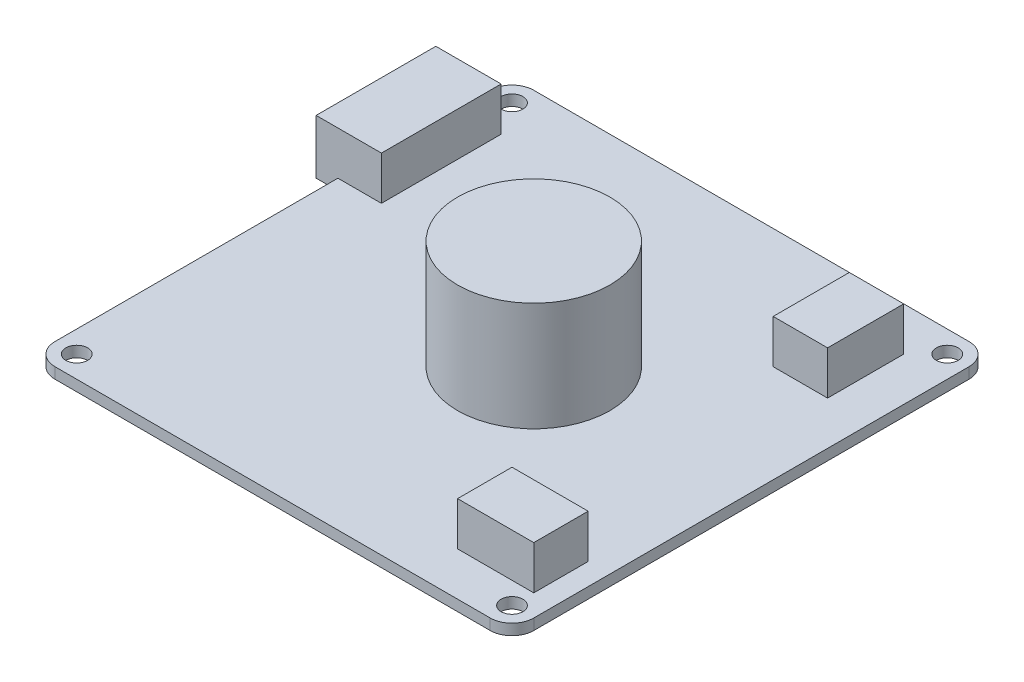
ISO-10303-21;
HEADER;
FILE_DESCRIPTION(('STEP AP214'),'2;1');
FILE_NAME('part.step','',(''),(''),'','','');
FILE_SCHEMA(('AUTOMOTIVE_DESIGN { 1 0 10303 214 1 1 1 1 }'));
ENDSEC;
DATA;
#1=APPLICATION_CONTEXT('core data for automotive mechanical design processes');
#2=APPLICATION_PROTOCOL_DEFINITION('international standard','automotive_design',2000,#1);
#3=PRODUCT_CONTEXT('',#1,'mechanical');
#4=PRODUCT('Part','Part','',(#3));
#5=PRODUCT_RELATED_PRODUCT_CATEGORY('part','',(#4));
#6=PRODUCT_DEFINITION_FORMATION('','',#4);
#7=PRODUCT_DEFINITION_CONTEXT('part definition',#1,'design');
#8=PRODUCT_DEFINITION('design','',#6,#7);
#9=PRODUCT_DEFINITION_SHAPE('','',#8);
#10=(LENGTH_UNIT() NAMED_UNIT(*) SI_UNIT(.MILLI.,.METRE.));
#11=(NAMED_UNIT(*) PLANE_ANGLE_UNIT() SI_UNIT($,.RADIAN.));
#12=(NAMED_UNIT(*) SI_UNIT($,.STERADIAN.) SOLID_ANGLE_UNIT());
#13=UNCERTAINTY_MEASURE_WITH_UNIT(LENGTH_MEASURE(1.E-05),#10,'distance_accuracy_value','');
#14=(GEOMETRIC_REPRESENTATION_CONTEXT(3) GLOBAL_UNCERTAINTY_ASSIGNED_CONTEXT((#13)) GLOBAL_UNIT_ASSIGNED_CONTEXT((#10,
#11,#12)) REPRESENTATION_CONTEXT('',''));
#15=CARTESIAN_POINT('',(0.,0.,0.));
#16=DIRECTION('',(0.,0.,1.));
#17=DIRECTION('',(1.,0.,0.));
#18=AXIS2_PLACEMENT_3D('',#15,#16,#17);
#19=CARTESIAN_POINT('',(-20.,1.,20.));
#20=DIRECTION('',(0.,-1.,0.));
#21=DIRECTION('',(0.,0.,-1.));
#22=AXIS2_PLACEMENT_3D('',#19,#20,#21);
#23=CYLINDRICAL_SURFACE('',#22,2.);
#24=CARTESIAN_POINT('',(-20.,0.,20.));
#25=DIRECTION('',(0.,1.,0.));
#26=DIRECTION('',(0.,0.,1.));
#27=AXIS2_PLACEMENT_3D('',#24,#25,#26);
#28=CIRCLE('',#27,2.);
#29=CARTESIAN_POINT('',(-20.,0.,22.));
#30=VERTEX_POINT('',#29);
#31=CARTESIAN_POINT('',(-22.,0.,20.));
#32=VERTEX_POINT('',#31);
#33=EDGE_CURVE('E290',#30,#32,#28,.F.);
#34=ORIENTED_EDGE('',*,*,#33,.F.);
#35=DIRECTION('',(0.,-1.,0.));
#36=VECTOR('',#35,1.);
#37=CARTESIAN_POINT('',(-20.,1.,22.));
#38=LINE('',#37,#36);
#39=CARTESIAN_POINT('',(-20.,1.,22.));
#40=VERTEX_POINT('',#39);
#41=EDGE_CURVE('E11',#40,#30,#38,.T.);
#42=ORIENTED_EDGE('',*,*,#41,.F.);
#43=CARTESIAN_POINT('',(-20.,1.,20.));
#44=DIRECTION('',(0.,1.,0.));
#45=DIRECTION('',(0.,0.,1.));
#46=AXIS2_PLACEMENT_3D('',#43,#44,#45);
#47=CIRCLE('',#46,2.);
#48=CARTESIAN_POINT('',(-22.,1.,20.));
#49=VERTEX_POINT('',#48);
#50=EDGE_CURVE('E233',#40,#49,#47,.F.);
#51=ORIENTED_EDGE('',*,*,#50,.T.);
#52=DIRECTION('',(0.,-1.,0.));
#53=VECTOR('',#52,1.);
#54=CARTESIAN_POINT('',(-22.,1.,20.));
#55=LINE('',#54,#53);
#56=EDGE_CURVE('E89',#49,#32,#55,.T.);
#57=ORIENTED_EDGE('',*,*,#56,.T.);
#58=EDGE_LOOP('',(#34,#42,#51,#57));
#59=FACE_BOUND('',#58,.T.);
#60=ADVANCED_FACE('F35',(#59),#23,.T.);
#61=CARTESIAN_POINT('',(0.,1.,22.));
#62=DIRECTION('',(0.,0.,-1.));
#63=DIRECTION('',(-1.,0.,0.));
#64=AXIS2_PLACEMENT_3D('',#61,#62,#63);
#65=PLANE('',#64);
#66=DIRECTION('',(1.,0.,0.));
#67=VECTOR('',#66,1.);
#68=CARTESIAN_POINT('',(0.,0.,22.));
#69=LINE('',#68,#67);
#70=CARTESIAN_POINT('',(20.,0.,22.));
#71=VERTEX_POINT('',#70);
#72=EDGE_CURVE('E292',#30,#71,#69,.T.);
#73=ORIENTED_EDGE('',*,*,#72,.T.);
#74=DIRECTION('',(0.,-1.,0.));
#75=VECTOR('',#74,1.);
#76=CARTESIAN_POINT('',(20.,1.,22.));
#77=LINE('',#76,#75);
#78=CARTESIAN_POINT('',(20.,1.,22.));
#79=VERTEX_POINT('',#78);
#80=EDGE_CURVE('E44',#79,#71,#77,.T.);
#81=ORIENTED_EDGE('',*,*,#80,.F.);
#82=DIRECTION('',(1.,0.,0.));
#83=VECTOR('',#82,1.);
#84=CARTESIAN_POINT('',(0.,1.,22.));
#85=LINE('',#84,#83);
#86=EDGE_CURVE('E235',#40,#79,#85,.T.);
#87=ORIENTED_EDGE('',*,*,#86,.F.);
#88=ORIENTED_EDGE('',*,*,#41,.T.);
#89=EDGE_LOOP('',(#73,#81,#87,#88));
#90=FACE_BOUND('',#89,.T.);
#91=ADVANCED_FACE('F336',(#90),#65,.F.);
#92=CARTESIAN_POINT('',(20.,1.,20.));
#93=DIRECTION('',(0.,-1.,0.));
#94=DIRECTION('',(0.,0.,-1.));
#95=AXIS2_PLACEMENT_3D('',#92,#93,#94);
#96=CYLINDRICAL_SURFACE('',#95,2.00000000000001);
#97=CARTESIAN_POINT('',(20.,0.,20.));
#98=DIRECTION('',(0.,1.,0.));
#99=DIRECTION('',(0.,0.,1.));
#100=AXIS2_PLACEMENT_3D('',#97,#98,#99);
#101=CIRCLE('',#100,2.00000000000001);
#102=CARTESIAN_POINT('',(22.,0.,20.));
#103=VERTEX_POINT('',#102);
#104=EDGE_CURVE('E295',#71,#103,#101,.T.);
#105=ORIENTED_EDGE('',*,*,#104,.T.);
#106=DIRECTION('',(0.,-1.,0.));
#107=VECTOR('',#106,1.);
#108=CARTESIAN_POINT('',(22.,1.,20.));
#109=LINE('',#108,#107);
#110=CARTESIAN_POINT('',(22.,1.,20.));
#111=VERTEX_POINT('',#110);
#112=EDGE_CURVE('E327',#111,#103,#109,.T.);
#113=ORIENTED_EDGE('',*,*,#112,.F.);
#114=CARTESIAN_POINT('',(20.,1.,20.));
#115=DIRECTION('',(0.,1.,0.));
#116=DIRECTION('',(0.,0.,1.));
#117=AXIS2_PLACEMENT_3D('',#114,#115,#116);
#118=CIRCLE('',#117,2.00000000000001);
#119=EDGE_CURVE('E238',#79,#111,#118,.T.);
#120=ORIENTED_EDGE('',*,*,#119,.F.);
#121=ORIENTED_EDGE('',*,*,#80,.T.);
#122=EDGE_LOOP('',(#105,#113,#120,#121));
#123=FACE_BOUND('',#122,.T.);
#124=ADVANCED_FACE('F332',(#123),#96,.T.);
#125=CARTESIAN_POINT('',(22.,1.,0.));
#126=DIRECTION('',(-1.,0.,0.));
#127=DIRECTION('',(0.,0.,1.));
#128=AXIS2_PLACEMENT_3D('',#125,#126,#127);
#129=PLANE('',#128);
#130=DIRECTION('',(0.,0.,-1.));
#131=VECTOR('',#130,1.);
#132=CARTESIAN_POINT('',(22.,0.,0.));
#133=LINE('',#132,#131);
#134=CARTESIAN_POINT('',(22.,0.,-20.));
#135=VERTEX_POINT('',#134);
#136=EDGE_CURVE('E298',#103,#135,#133,.T.);
#137=ORIENTED_EDGE('',*,*,#136,.T.);
#138=DIRECTION('',(0.,-1.,0.));
#139=VECTOR('',#138,1.);
#140=CARTESIAN_POINT('',(22.,1.,-20.));
#141=LINE('',#140,#139);
#142=CARTESIAN_POINT('',(22.,1.,-20.));
#143=VERTEX_POINT('',#142);
#144=EDGE_CURVE('E325',#143,#135,#141,.T.);
#145=ORIENTED_EDGE('',*,*,#144,.F.);
#146=DIRECTION('',(0.,0.,-1.));
#147=VECTOR('',#146,1.);
#148=CARTESIAN_POINT('',(22.,1.,0.));
#149=LINE('',#148,#147);
#150=EDGE_CURVE('E241',#111,#143,#149,.T.);
#151=ORIENTED_EDGE('',*,*,#150,.F.);
#152=ORIENTED_EDGE('',*,*,#112,.T.);
#153=EDGE_LOOP('',(#137,#145,#151,#152));
#154=FACE_BOUND('',#153,.T.);
#155=ADVANCED_FACE('F403',(#154),#129,.F.);
#156=CARTESIAN_POINT('',(20.,1.,-20.));
#157=DIRECTION('',(0.,-1.,0.));
#158=DIRECTION('',(0.,0.,-1.));
#159=AXIS2_PLACEMENT_3D('',#156,#157,#158);
#160=CYLINDRICAL_SURFACE('',#159,2.);
#161=CARTESIAN_POINT('',(20.,0.,-20.));
#162=DIRECTION('',(0.,1.,0.));
#163=DIRECTION('',(0.,0.,1.));
#164=AXIS2_PLACEMENT_3D('',#161,#162,#163);
#165=CIRCLE('',#164,2.);
#166=CARTESIAN_POINT('',(20.,0.,-22.));
#167=VERTEX_POINT('',#166);
#168=EDGE_CURVE('E301',#167,#135,#165,.F.);
#169=ORIENTED_EDGE('',*,*,#168,.F.);
#170=DIRECTION('',(0.,-1.,0.));
#171=VECTOR('',#170,1.);
#172=CARTESIAN_POINT('',(20.,1.,-22.));
#173=LINE('',#172,#171);
#174=CARTESIAN_POINT('',(20.,1.,-22.));
#175=VERTEX_POINT('',#174);
#176=EDGE_CURVE('E323',#175,#167,#173,.T.);
#177=ORIENTED_EDGE('',*,*,#176,.F.);
#178=CARTESIAN_POINT('',(20.,1.,-20.));
#179=DIRECTION('',(0.,1.,0.));
#180=DIRECTION('',(0.,0.,1.));
#181=AXIS2_PLACEMENT_3D('',#178,#179,#180);
#182=CIRCLE('',#181,2.);
#183=EDGE_CURVE('E243',#175,#143,#182,.F.);
#184=ORIENTED_EDGE('',*,*,#183,.T.);
#185=ORIENTED_EDGE('',*,*,#144,.T.);
#186=EDGE_LOOP('',(#169,#177,#184,#185));
#187=FACE_BOUND('',#186,.T.);
#188=ADVANCED_FACE('F399',(#187),#160,.T.);
#189=CARTESIAN_POINT('',(0.,1.,-22.));
#190=DIRECTION('',(0.,0.,-1.));
#191=DIRECTION('',(-1.,0.,0.));
#192=AXIS2_PLACEMENT_3D('',#189,#190,#191);
#193=PLANE('',#192);
#194=DIRECTION('',(1.,0.,0.));
#195=VECTOR('',#194,1.);
#196=CARTESIAN_POINT('',(0.,0.,-22.));
#197=LINE('',#196,#195);
#198=CARTESIAN_POINT('',(-20.,0.,-22.));
#199=VERTEX_POINT('',#198);
#200=EDGE_CURVE('E304',#199,#167,#197,.T.);
#201=ORIENTED_EDGE('',*,*,#200,.F.);
#202=DIRECTION('',(0.,-1.,0.));
#203=VECTOR('',#202,1.);
#204=CARTESIAN_POINT('',(-20.,1.,-22.));
#205=LINE('',#204,#203);
#206=CARTESIAN_POINT('',(-20.,1.,-22.));
#207=VERTEX_POINT('',#206);
#208=EDGE_CURVE('E321',#207,#199,#205,.T.);
#209=ORIENTED_EDGE('',*,*,#208,.F.);
#210=DIRECTION('',(1.,0.,0.));
#211=VECTOR('',#210,1.);
#212=CARTESIAN_POINT('',(0.,1.,-22.));
#213=LINE('',#212,#211);
#214=EDGE_CURVE('E246',#207,#175,#213,.T.);
#215=ORIENTED_EDGE('',*,*,#214,.T.);
#216=ORIENTED_EDGE('',*,*,#176,.T.);
#217=EDGE_LOOP('',(#201,#209,#215,#216));
#218=FACE_BOUND('',#217,.T.);
#219=ADVANCED_FACE('F395',(#218),#193,.T.);
#220=CARTESIAN_POINT('',(-20.,1.,-20.));
#221=DIRECTION('',(0.,-1.,0.));
#222=DIRECTION('',(0.,0.,-1.));
#223=AXIS2_PLACEMENT_3D('',#220,#221,#222);
#224=CYLINDRICAL_SURFACE('',#223,2.);
#225=CARTESIAN_POINT('',(-20.,0.,-20.));
#226=DIRECTION('',(0.,1.,0.));
#227=DIRECTION('',(0.,0.,1.));
#228=AXIS2_PLACEMENT_3D('',#225,#226,#227);
#229=CIRCLE('',#228,2.);
#230=CARTESIAN_POINT('',(-22.,0.,-20.));
#231=VERTEX_POINT('',#230);
#232=EDGE_CURVE('E307',#231,#199,#229,.F.);
#233=ORIENTED_EDGE('',*,*,#232,.F.);
#234=DIRECTION('',(0.,-1.,0.));
#235=VECTOR('',#234,1.);
#236=CARTESIAN_POINT('',(-22.,1.,-20.));
#237=LINE('',#236,#235);
#238=CARTESIAN_POINT('',(-22.,1.,-20.));
#239=VERTEX_POINT('',#238);
#240=EDGE_CURVE('E81',#239,#231,#237,.T.);
#241=ORIENTED_EDGE('',*,*,#240,.F.);
#242=CARTESIAN_POINT('',(-20.,1.,-20.));
#243=DIRECTION('',(0.,1.,0.));
#244=DIRECTION('',(0.,0.,1.));
#245=AXIS2_PLACEMENT_3D('',#242,#243,#244);
#246=CIRCLE('',#245,2.);
#247=EDGE_CURVE('E249',#239,#207,#246,.F.);
#248=ORIENTED_EDGE('',*,*,#247,.T.);
#249=ORIENTED_EDGE('',*,*,#208,.T.);
#250=EDGE_LOOP('',(#233,#241,#248,#249));
#251=FACE_BOUND('',#250,.T.);
#252=ADVANCED_FACE('F392',(#251),#224,.T.);
#253=CARTESIAN_POINT('',(-22.,1.,0.));
#254=DIRECTION('',(-1.,0.,0.));
#255=DIRECTION('',(0.,0.,1.));
#256=AXIS2_PLACEMENT_3D('',#253,#254,#255);
#257=PLANE('',#256);
#258=DIRECTION('',(0.,0.,-1.));
#259=VECTOR('',#258,1.);
#260=CARTESIAN_POINT('',(-22.,0.,0.));
#261=LINE('',#260,#259);
#262=CARTESIAN_POINT('',(-22.,0.,-17.));
#263=VERTEX_POINT('',#262);
#264=EDGE_CURVE('E310',#263,#231,#261,.T.);
#265=ORIENTED_EDGE('',*,*,#264,.F.);
#266=DIRECTION('',(0.,-1.,0.));
#267=VECTOR('',#266,1.);
#268=CARTESIAN_POINT('',(-22.,1.,-17.));
#269=LINE('',#268,#267);
#270=CARTESIAN_POINT('',(-22.,1.,-17.));
#271=VERTEX_POINT('',#270);
#272=EDGE_CURVE('E317',#271,#263,#269,.T.);
#273=ORIENTED_EDGE('',*,*,#272,.F.);
#274=DIRECTION('',(0.,0.,-1.));
#275=VECTOR('',#274,1.);
#276=CARTESIAN_POINT('',(-22.,1.,0.));
#277=LINE('',#276,#275);
#278=EDGE_CURVE('E252',#271,#239,#277,.T.);
#279=ORIENTED_EDGE('',*,*,#278,.T.);
#280=ORIENTED_EDGE('',*,*,#240,.T.);
#281=EDGE_LOOP('',(#265,#273,#279,#280));
#282=FACE_BOUND('',#281,.T.);
#283=ADVANCED_FACE('F390',(#282),#257,.T.);
#284=CARTESIAN_POINT('',(-22.,0.,-6.));
#285=VERTEX_POINT('',#284);
#286=EDGE_CURVE('E224',#32,#285,#261,.T.);
#287=ORIENTED_EDGE('',*,*,#286,.F.);
#288=ORIENTED_EDGE('',*,*,#56,.F.);
#289=CARTESIAN_POINT('',(-22.,1.,-6.));
#290=VERTEX_POINT('',#289);
#291=EDGE_CURVE('E255',#49,#290,#277,.T.);
#292=ORIENTED_EDGE('',*,*,#291,.T.);
#293=DIRECTION('',(0.,-1.,0.));
#294=VECTOR('',#293,1.);
#295=CARTESIAN_POINT('',(-22.,1.,-6.));
#296=LINE('',#295,#294);
#297=EDGE_CURVE('E314',#290,#285,#296,.T.);
#298=ORIENTED_EDGE('',*,*,#297,.T.);
#299=EDGE_LOOP('',(#287,#288,#292,#298));
#300=FACE_BOUND('',#299,.T.);
#301=ADVANCED_FACE('F353',(#300),#257,.T.);
#302=CARTESIAN_POINT('',(-20.,1.,-20.));
#303=DIRECTION('',(0.,-1.,0.));
#304=DIRECTION('',(0.,0.,-1.));
#305=AXIS2_PLACEMENT_3D('',#302,#303,#304);
#306=CYLINDRICAL_SURFACE('',#305,1.);
#307=CARTESIAN_POINT('',(-20.,1.,-20.));
#308=DIRECTION('',(0.,1.,0.));
#309=DIRECTION('',(0.,0.,1.));
#310=AXIS2_PLACEMENT_3D('',#307,#308,#309);
#311=CIRCLE('',#310,1.);
#312=CARTESIAN_POINT('',(-20.,1.,-19.));
#313=VERTEX_POINT('',#312);
#314=EDGE_CURVE('E230',#313,#313,#311,.T.);
#315=ORIENTED_EDGE('',*,*,#314,.T.);
#316=EDGE_LOOP('',(#315));
#317=FACE_BOUND('',#316,.T.);
#318=CARTESIAN_POINT('',(-20.,0.,-20.));
#319=DIRECTION('',(0.,1.,0.));
#320=DIRECTION('',(0.,0.,1.));
#321=AXIS2_PLACEMENT_3D('',#318,#319,#320);
#322=CIRCLE('',#321,1.);
#323=CARTESIAN_POINT('',(-20.,0.,-19.));
#324=VERTEX_POINT('',#323);
#325=EDGE_CURVE('E287',#324,#324,#322,.T.);
#326=ORIENTED_EDGE('',*,*,#325,.F.);
#327=EDGE_LOOP('',(#326));
#328=FACE_BOUND('',#327,.T.);
#329=ADVANCED_FACE('F349',(#317,#328),#306,.F.);
#330=CARTESIAN_POINT('',(20.,1.,-20.));
#331=DIRECTION('',(0.,-1.,0.));
#332=DIRECTION('',(0.,0.,-1.));
#333=AXIS2_PLACEMENT_3D('',#330,#331,#332);
#334=CYLINDRICAL_SURFACE('',#333,1.);
#335=CARTESIAN_POINT('',(20.,1.,-20.));
#336=DIRECTION('',(0.,1.,0.));
#337=DIRECTION('',(0.,0.,1.));
#338=AXIS2_PLACEMENT_3D('',#335,#336,#337);
#339=CIRCLE('',#338,1.);
#340=CARTESIAN_POINT('',(20.,1.,-19.));
#341=VERTEX_POINT('',#340);
#342=EDGE_CURVE('E227',#341,#341,#339,.T.);
#343=ORIENTED_EDGE('',*,*,#342,.T.);
#344=EDGE_LOOP('',(#343));
#345=FACE_BOUND('',#344,.T.);
#346=CARTESIAN_POINT('',(20.,0.,-20.));
#347=DIRECTION('',(0.,1.,0.));
#348=DIRECTION('',(0.,0.,1.));
#349=AXIS2_PLACEMENT_3D('',#346,#347,#348);
#350=CIRCLE('',#349,1.);
#351=CARTESIAN_POINT('',(20.,0.,-19.));
#352=VERTEX_POINT('',#351);
#353=EDGE_CURVE('E284',#352,#352,#350,.T.);
#354=ORIENTED_EDGE('',*,*,#353,.F.);
#355=EDGE_LOOP('',(#354));
#356=FACE_BOUND('',#355,.T.);
#357=ADVANCED_FACE('F352',(#345,#356),#334,.F.);
#358=CARTESIAN_POINT('',(20.,1.,20.));
#359=DIRECTION('',(0.,-1.,0.));
#360=DIRECTION('',(0.,0.,-1.));
#361=AXIS2_PLACEMENT_3D('',#358,#359,#360);
#362=CYLINDRICAL_SURFACE('',#361,1.);
#363=CARTESIAN_POINT('',(20.,1.,20.));
#364=DIRECTION('',(0.,1.,0.));
#365=DIRECTION('',(0.,0.,1.));
#366=AXIS2_PLACEMENT_3D('',#363,#364,#365);
#367=CIRCLE('',#366,1.);
#368=CARTESIAN_POINT('',(20.,1.,21.));
#369=VERTEX_POINT('',#368);
#370=EDGE_CURVE('E223',#369,#369,#367,.T.);
#371=ORIENTED_EDGE('',*,*,#370,.T.);
#372=EDGE_LOOP('',(#371));
#373=FACE_BOUND('',#372,.T.);
#374=CARTESIAN_POINT('',(20.,0.,20.));
#375=DIRECTION('',(0.,1.,0.));
#376=DIRECTION('',(0.,0.,1.));
#377=AXIS2_PLACEMENT_3D('',#374,#375,#376);
#378=CIRCLE('',#377,1.);
#379=CARTESIAN_POINT('',(20.,0.,21.));
#380=VERTEX_POINT('',#379);
#381=EDGE_CURVE('E281',#380,#380,#378,.T.);
#382=ORIENTED_EDGE('',*,*,#381,.F.);
#383=EDGE_LOOP('',(#382));
#384=FACE_BOUND('',#383,.T.);
#385=ADVANCED_FACE('F356',(#373,#384),#362,.F.);
#386=CARTESIAN_POINT('',(-20.,1.,20.));
#387=DIRECTION('',(0.,-1.,0.));
#388=DIRECTION('',(0.,0.,-1.));
#389=AXIS2_PLACEMENT_3D('',#386,#387,#388);
#390=CYLINDRICAL_SURFACE('',#389,1.);
#391=CARTESIAN_POINT('',(-20.,1.,20.));
#392=DIRECTION('',(0.,1.,0.));
#393=DIRECTION('',(0.,0.,1.));
#394=AXIS2_PLACEMENT_3D('',#391,#392,#393);
#395=CIRCLE('',#394,1.);
#396=CARTESIAN_POINT('',(-20.,1.,21.));
#397=VERTEX_POINT('',#396);
#398=EDGE_CURVE('E220',#397,#397,#395,.T.);
#399=ORIENTED_EDGE('',*,*,#398,.T.);
#400=EDGE_LOOP('',(#399));
#401=FACE_BOUND('',#400,.T.);
#402=CARTESIAN_POINT('',(-20.,0.,20.));
#403=DIRECTION('',(0.,1.,0.));
#404=DIRECTION('',(0.,0.,1.));
#405=AXIS2_PLACEMENT_3D('',#402,#403,#404);
#406=CIRCLE('',#405,1.);
#407=CARTESIAN_POINT('',(-20.,0.,21.));
#408=VERTEX_POINT('',#407);
#409=EDGE_CURVE('E219',#408,#408,#406,.T.);
#410=ORIENTED_EDGE('',*,*,#409,.F.);
#411=EDGE_LOOP('',(#410));
#412=FACE_BOUND('',#411,.T.);
#413=ADVANCED_FACE('F37',(#401,#412),#390,.F.);
#414=CARTESIAN_POINT('',(0.,1.,0.));
#415=DIRECTION('',(0.,1.,0.));
#416=DIRECTION('',(0.,0.,1.));
#417=AXIS2_PLACEMENT_3D('',#414,#415,#416);
#418=PLANE('',#417);
#419=ORIENTED_EDGE('',*,*,#398,.F.);
#420=EDGE_LOOP('',(#419));
#421=FACE_BOUND('',#420,.T.);
#422=ORIENTED_EDGE('',*,*,#370,.F.);
#423=EDGE_LOOP('',(#422));
#424=FACE_BOUND('',#423,.T.);
#425=ORIENTED_EDGE('',*,*,#342,.F.);
#426=EDGE_LOOP('',(#425));
#427=FACE_BOUND('',#426,.T.);
#428=ORIENTED_EDGE('',*,*,#314,.F.);
#429=EDGE_LOOP('',(#428));
#430=FACE_BOUND('',#429,.T.);
#431=ORIENTED_EDGE('',*,*,#50,.F.);
#432=ORIENTED_EDGE('',*,*,#86,.T.);
#433=ORIENTED_EDGE('',*,*,#119,.T.);
#434=ORIENTED_EDGE('',*,*,#150,.T.);
#435=ORIENTED_EDGE('',*,*,#183,.F.);
#436=ORIENTED_EDGE('',*,*,#214,.F.);
#437=ORIENTED_EDGE('',*,*,#247,.F.);
#438=ORIENTED_EDGE('',*,*,#278,.F.);
#439=DIRECTION('',(1.,0.,0.));
#440=VECTOR('',#439,1.);
#441=CARTESIAN_POINT('',(0.,1.,-17.));
#442=LINE('',#441,#440);
#443=CARTESIAN_POINT('',(-18.,1.,-17.));
#444=VERTEX_POINT('',#443);
#445=EDGE_CURVE('E254',#271,#444,#442,.T.);
#446=ORIENTED_EDGE('',*,*,#445,.T.);
#447=DIRECTION('',(0.,0.,1.));
#448=VECTOR('',#447,1.);
#449=CARTESIAN_POINT('',(-18.,1.,0.));
#450=LINE('',#449,#448);
#451=CARTESIAN_POINT('',(-18.,1.,-6.));
#452=VERTEX_POINT('',#451);
#453=EDGE_CURVE('E258',#444,#452,#450,.T.);
#454=ORIENTED_EDGE('',*,*,#453,.T.);
#455=DIRECTION('',(1.,0.,0.));
#456=VECTOR('',#455,1.);
#457=CARTESIAN_POINT('',(0.,1.,-5.99999999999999));
#458=LINE('',#457,#456);
#459=EDGE_CURVE('E261',#290,#452,#458,.T.);
#460=ORIENTED_EDGE('',*,*,#459,.F.);
#461=ORIENTED_EDGE('',*,*,#291,.F.);
#462=EDGE_LOOP('',(#431,#432,#433,#434,#435,#436,#437,#438,#446,#454,#460,#461));
#463=FACE_BOUND('',#462,.T.);
#464=CARTESIAN_POINT('',(2.,1.,0.));
#465=DIRECTION('',(0.,1.,0.));
#466=DIRECTION('',(0.,0.,1.));
#467=AXIS2_PLACEMENT_3D('',#464,#465,#466);
#468=CIRCLE('',#467,7.);
#469=CARTESIAN_POINT('',(2.,1.,7.));
#470=VERTEX_POINT('',#469);
#471=EDGE_CURVE('E264',#470,#470,#468,.T.);
#472=ORIENTED_EDGE('',*,*,#471,.F.);
#473=EDGE_LOOP('',(#472));
#474=FACE_BOUND('',#473,.T.);
#475=DIRECTION('',(1.,0.,0.));
#476=VECTOR('',#475,1.);
#477=CARTESIAN_POINT('',(0.,1.,-18.));
#478=LINE('',#477,#476);
#479=CARTESIAN_POINT('',(13.,1.,-18.));
#480=VERTEX_POINT('',#479);
#481=CARTESIAN_POINT('',(18.,1.,-18.));
#482=VERTEX_POINT('',#481);
#483=EDGE_CURVE('E267',#480,#482,#478,.T.);
#484=ORIENTED_EDGE('',*,*,#483,.T.);
#485=DIRECTION('',(0.,0.,1.));
#486=VECTOR('',#485,1.);
#487=CARTESIAN_POINT('',(18.,1.,0.));
#488=LINE('',#487,#486);
#489=CARTESIAN_POINT('',(18.,1.,-11.));
#490=VERTEX_POINT('',#489);
#491=EDGE_CURVE('E269',#482,#490,#488,.T.);
#492=ORIENTED_EDGE('',*,*,#491,.T.);
#493=DIRECTION('',(1.,0.,0.));
#494=VECTOR('',#493,1.);
#495=CARTESIAN_POINT('',(0.,1.,-11.));
#496=LINE('',#495,#494);
#497=CARTESIAN_POINT('',(13.,1.,-11.));
#498=VERTEX_POINT('',#497);
#499=EDGE_CURVE('E272',#498,#490,#496,.T.);
#500=ORIENTED_EDGE('',*,*,#499,.F.);
#501=DIRECTION('',(0.,0.,1.));
#502=VECTOR('',#501,1.);
#503=CARTESIAN_POINT('',(13.,1.,0.));
#504=LINE('',#503,#502);
#505=EDGE_CURVE('E135',#480,#498,#504,.T.);
#506=ORIENTED_EDGE('',*,*,#505,.F.);
#507=EDGE_LOOP('',(#484,#492,#500,#506));
#508=FACE_BOUND('',#507,.T.);
#509=DIRECTION('',(1.,0.,0.));
#510=VECTOR('',#509,1.);
#511=CARTESIAN_POINT('',(0.,1.,13.));
#512=LINE('',#511,#510);
#513=CARTESIAN_POINT('',(13.,1.,13.));
#514=VERTEX_POINT('',#513);
#515=CARTESIAN_POINT('',(20.,1.,13.));
#516=VERTEX_POINT('',#515);
#517=EDGE_CURVE('E125',#514,#516,#512,.T.);
#518=ORIENTED_EDGE('',*,*,#517,.T.);
#519=DIRECTION('',(0.,0.,1.));
#520=VECTOR('',#519,1.);
#521=CARTESIAN_POINT('',(20.,1.,0.));
#522=LINE('',#521,#520);
#523=CARTESIAN_POINT('',(20.,1.,18.));
#524=VERTEX_POINT('',#523);
#525=EDGE_CURVE('E129',#516,#524,#522,.T.);
#526=ORIENTED_EDGE('',*,*,#525,.T.);
#527=DIRECTION('',(1.,0.,0.));
#528=VECTOR('',#527,1.);
#529=CARTESIAN_POINT('',(0.,1.,18.));
#530=LINE('',#529,#528);
#531=CARTESIAN_POINT('',(13.,1.,18.));
#532=VERTEX_POINT('',#531);
#533=EDGE_CURVE('E147',#532,#524,#530,.T.);
#534=ORIENTED_EDGE('',*,*,#533,.F.);
#535=DIRECTION('',(0.,0.,1.));
#536=VECTOR('',#535,1.);
#537=CARTESIAN_POINT('',(13.,1.,0.));
#538=LINE('',#537,#536);
#539=EDGE_CURVE('E52',#514,#532,#538,.T.);
#540=ORIENTED_EDGE('',*,*,#539,.F.);
#541=EDGE_LOOP('',(#518,#526,#534,#540));
#542=FACE_BOUND('',#541,.T.);
#543=ADVANCED_FACE('F127',(#421,#424,#427,#430,#463,#474,#508,#542),#418,.T.);
#544=CARTESIAN_POINT('',(0.,0.,0.));
#545=DIRECTION('',(0.,1.,0.));
#546=DIRECTION('',(0.,0.,1.));
#547=AXIS2_PLACEMENT_3D('',#544,#545,#546);
#548=PLANE('',#547);
#549=ORIENTED_EDGE('',*,*,#409,.T.);
#550=EDGE_LOOP('',(#549));
#551=FACE_BOUND('',#550,.T.);
#552=ORIENTED_EDGE('',*,*,#381,.T.);
#553=EDGE_LOOP('',(#552));
#554=FACE_BOUND('',#553,.T.);
#555=ORIENTED_EDGE('',*,*,#353,.T.);
#556=EDGE_LOOP('',(#555));
#557=FACE_BOUND('',#556,.T.);
#558=ORIENTED_EDGE('',*,*,#325,.T.);
#559=EDGE_LOOP('',(#558));
#560=FACE_BOUND('',#559,.T.);
#561=ORIENTED_EDGE('',*,*,#33,.T.);
#562=ORIENTED_EDGE('',*,*,#286,.T.);
#563=DIRECTION('',(1.,0.,0.));
#564=VECTOR('',#563,1.);
#565=CARTESIAN_POINT('',(0.,0.,-5.99999999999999));
#566=LINE('',#565,#564);
#567=CARTESIAN_POINT('',(-24.,0.,-6.));
#568=VERTEX_POINT('',#567);
#569=EDGE_CURVE('E188',#568,#285,#566,.T.);
#570=ORIENTED_EDGE('',*,*,#569,.F.);
#571=DIRECTION('',(0.,0.,1.));
#572=VECTOR('',#571,1.);
#573=CARTESIAN_POINT('',(-24.,0.,0.));
#574=LINE('',#573,#572);
#575=CARTESIAN_POINT('',(-24.,0.,-17.));
#576=VERTEX_POINT('',#575);
#577=EDGE_CURVE('E200',#576,#568,#574,.T.);
#578=ORIENTED_EDGE('',*,*,#577,.F.);
#579=DIRECTION('',(1.,0.,0.));
#580=VECTOR('',#579,1.);
#581=CARTESIAN_POINT('',(0.,0.,-17.));
#582=LINE('',#581,#580);
#583=EDGE_CURVE('E183',#576,#263,#582,.T.);
#584=ORIENTED_EDGE('',*,*,#583,.T.);
#585=ORIENTED_EDGE('',*,*,#264,.T.);
#586=ORIENTED_EDGE('',*,*,#232,.T.);
#587=ORIENTED_EDGE('',*,*,#200,.T.);
#588=ORIENTED_EDGE('',*,*,#168,.T.);
#589=ORIENTED_EDGE('',*,*,#136,.F.);
#590=ORIENTED_EDGE('',*,*,#104,.F.);
#591=ORIENTED_EDGE('',*,*,#72,.F.);
#592=EDGE_LOOP('',(#561,#562,#570,#578,#584,#585,#586,#587,#588,#589,#590,#591));
#593=FACE_BOUND('',#592,.T.);
#594=ADVANCED_FACE('F338',(#551,#554,#557,#560,#593),#548,.F.);
#595=CARTESIAN_POINT('',(2.,11.,0.));
#596=DIRECTION('',(0.,-1.,0.));
#597=DIRECTION('',(0.,0.,-1.));
#598=AXIS2_PLACEMENT_3D('',#595,#596,#597);
#599=CYLINDRICAL_SURFACE('',#598,7.);
#600=ORIENTED_EDGE('',*,*,#471,.T.);
#601=EDGE_LOOP('',(#600));
#602=FACE_BOUND('',#601,.T.);
#603=CARTESIAN_POINT('',(2.,11.,0.));
#604=DIRECTION('',(0.,1.,0.));
#605=DIRECTION('',(0.,0.,1.));
#606=AXIS2_PLACEMENT_3D('',#603,#604,#605);
#607=CIRCLE('',#606,7.);
#608=CARTESIAN_POINT('',(2.,11.,7.));
#609=VERTEX_POINT('',#608);
#610=EDGE_CURVE('E216',#609,#609,#607,.T.);
#611=ORIENTED_EDGE('',*,*,#610,.F.);
#612=EDGE_LOOP('',(#611));
#613=FACE_BOUND('',#612,.T.);
#614=ADVANCED_FACE('F370',(#602,#613),#599,.T.);
#615=CARTESIAN_POINT('',(0.,11.,0.));
#616=DIRECTION('',(0.,1.,0.));
#617=DIRECTION('',(0.,0.,1.));
#618=AXIS2_PLACEMENT_3D('',#615,#616,#617);
#619=PLANE('',#618);
#620=ORIENTED_EDGE('',*,*,#610,.T.);
#621=EDGE_LOOP('',(#620));
#622=FACE_BOUND('',#621,.T.);
#623=ADVANCED_FACE('F382',(#622),#619,.T.);
#624=CARTESIAN_POINT('',(-18.,5.,0.));
#625=DIRECTION('',(1.,0.,0.));
#626=DIRECTION('',(0.,0.,-1.));
#627=AXIS2_PLACEMENT_3D('',#624,#625,#626);
#628=PLANE('',#627);
#629=DIRECTION('',(0.,-1.,0.));
#630=VECTOR('',#629,1.);
#631=CARTESIAN_POINT('',(-18.,5.,-6.));
#632=LINE('',#631,#630);
#633=CARTESIAN_POINT('',(-18.,5.,-6.));
#634=VERTEX_POINT('',#633);
#635=EDGE_CURVE('E197',#634,#452,#632,.T.);
#636=ORIENTED_EDGE('',*,*,#635,.T.);
#637=ORIENTED_EDGE('',*,*,#453,.F.);
#638=DIRECTION('',(0.,-1.,0.));
#639=VECTOR('',#638,1.);
#640=CARTESIAN_POINT('',(-18.,5.,-17.));
#641=LINE('',#640,#639);
#642=CARTESIAN_POINT('',(-18.,5.,-17.));
#643=VERTEX_POINT('',#642);
#644=EDGE_CURVE('E213',#643,#444,#641,.T.);
#645=ORIENTED_EDGE('',*,*,#644,.F.);
#646=DIRECTION('',(0.,0.,1.));
#647=VECTOR('',#646,1.);
#648=CARTESIAN_POINT('',(-18.,5.,0.));
#649=LINE('',#648,#647);
#650=EDGE_CURVE('E184',#643,#634,#649,.T.);
#651=ORIENTED_EDGE('',*,*,#650,.T.);
#652=EDGE_LOOP('',(#636,#637,#645,#651));
#653=FACE_BOUND('',#652,.T.);
#654=ADVANCED_FACE('F472',(#653),#628,.T.);
#655=CARTESIAN_POINT('',(0.,5.,-17.));
#656=DIRECTION('',(0.,0.,-1.));
#657=DIRECTION('',(-1.,0.,0.));
#658=AXIS2_PLACEMENT_3D('',#655,#656,#657);
#659=PLANE('',#658);
#660=ORIENTED_EDGE('',*,*,#445,.F.);
#661=ORIENTED_EDGE('',*,*,#272,.T.);
#662=ORIENTED_EDGE('',*,*,#583,.F.);
#663=DIRECTION('',(0.,-1.,0.));
#664=VECTOR('',#663,1.);
#665=CARTESIAN_POINT('',(-24.,5.,-17.));
#666=LINE('',#665,#664);
#667=CARTESIAN_POINT('',(-24.,5.,-17.));
#668=VERTEX_POINT('',#667);
#669=EDGE_CURVE('E210',#668,#576,#666,.T.);
#670=ORIENTED_EDGE('',*,*,#669,.F.);
#671=DIRECTION('',(1.,0.,0.));
#672=VECTOR('',#671,1.);
#673=CARTESIAN_POINT('',(0.,5.,-17.));
#674=LINE('',#673,#672);
#675=EDGE_CURVE('E187',#668,#643,#674,.T.);
#676=ORIENTED_EDGE('',*,*,#675,.T.);
#677=ORIENTED_EDGE('',*,*,#644,.T.);
#678=EDGE_LOOP('',(#660,#661,#662,#670,#676,#677));
#679=FACE_BOUND('',#678,.T.);
#680=ADVANCED_FACE('F483',(#679),#659,.T.);
#681=CARTESIAN_POINT('',(-24.,5.,0.));
#682=DIRECTION('',(1.,0.,0.));
#683=DIRECTION('',(0.,0.,-1.));
#684=AXIS2_PLACEMENT_3D('',#681,#682,#683);
#685=PLANE('',#684);
#686=ORIENTED_EDGE('',*,*,#577,.T.);
#687=DIRECTION('',(0.,-1.,0.));
#688=VECTOR('',#687,1.);
#689=CARTESIAN_POINT('',(-24.,5.,-6.));
#690=LINE('',#689,#688);
#691=CARTESIAN_POINT('',(-24.,5.,-6.));
#692=VERTEX_POINT('',#691);
#693=EDGE_CURVE('E207',#692,#568,#690,.T.);
#694=ORIENTED_EDGE('',*,*,#693,.F.);
#695=DIRECTION('',(0.,0.,1.));
#696=VECTOR('',#695,1.);
#697=CARTESIAN_POINT('',(-24.,5.,0.));
#698=LINE('',#697,#696);
#699=EDGE_CURVE('E191',#668,#692,#698,.T.);
#700=ORIENTED_EDGE('',*,*,#699,.F.);
#701=ORIENTED_EDGE('',*,*,#669,.T.);
#702=EDGE_LOOP('',(#686,#694,#700,#701));
#703=FACE_BOUND('',#702,.T.);
#704=ADVANCED_FACE('F491',(#703),#685,.F.);
#705=CARTESIAN_POINT('',(0.,5.,-5.99999999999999));
#706=DIRECTION('',(0.,0.,-1.));
#707=DIRECTION('',(-1.,0.,0.));
#708=AXIS2_PLACEMENT_3D('',#705,#706,#707);
#709=PLANE('',#708);
#710=ORIENTED_EDGE('',*,*,#297,.F.);
#711=ORIENTED_EDGE('',*,*,#459,.T.);
#712=ORIENTED_EDGE('',*,*,#635,.F.);
#713=DIRECTION('',(1.,0.,0.));
#714=VECTOR('',#713,1.);
#715=CARTESIAN_POINT('',(0.,5.,-5.99999999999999));
#716=LINE('',#715,#714);
#717=EDGE_CURVE('E194',#692,#634,#716,.T.);
#718=ORIENTED_EDGE('',*,*,#717,.F.);
#719=ORIENTED_EDGE('',*,*,#693,.T.);
#720=ORIENTED_EDGE('',*,*,#569,.T.);
#721=EDGE_LOOP('',(#710,#711,#712,#718,#719,#720));
#722=FACE_BOUND('',#721,.T.);
#723=ADVANCED_FACE('F499',(#722),#709,.F.);
#724=CARTESIAN_POINT('',(0.,5.,0.));
#725=DIRECTION('',(0.,1.,0.));
#726=DIRECTION('',(0.,0.,1.));
#727=AXIS2_PLACEMENT_3D('',#724,#725,#726);
#728=PLANE('',#727);
#729=ORIENTED_EDGE('',*,*,#650,.F.);
#730=ORIENTED_EDGE('',*,*,#675,.F.);
#731=ORIENTED_EDGE('',*,*,#699,.T.);
#732=ORIENTED_EDGE('',*,*,#717,.T.);
#733=EDGE_LOOP('',(#729,#730,#731,#732));
#734=FACE_BOUND('',#733,.T.);
#735=ADVANCED_FACE('F507',(#734),#728,.T.);
#736=CARTESIAN_POINT('',(18.,5.,0.));
#737=DIRECTION('',(1.,0.,0.));
#738=DIRECTION('',(0.,0.,-1.));
#739=AXIS2_PLACEMENT_3D('',#736,#737,#738);
#740=PLANE('',#739);
#741=DIRECTION('',(0.,-1.,0.));
#742=VECTOR('',#741,1.);
#743=CARTESIAN_POINT('',(18.,5.,-11.));
#744=LINE('',#743,#742);
#745=CARTESIAN_POINT('',(18.,5.,-11.));
#746=VERTEX_POINT('',#745);
#747=EDGE_CURVE('E171',#746,#490,#744,.T.);
#748=ORIENTED_EDGE('',*,*,#747,.T.);
#749=ORIENTED_EDGE('',*,*,#491,.F.);
#750=DIRECTION('',(0.,-1.,0.));
#751=VECTOR('',#750,1.);
#752=CARTESIAN_POINT('',(18.,5.,-18.));
#753=LINE('',#752,#751);
#754=CARTESIAN_POINT('',(18.,5.,-18.));
#755=VERTEX_POINT('',#754);
#756=EDGE_CURVE('E180',#755,#482,#753,.T.);
#757=ORIENTED_EDGE('',*,*,#756,.F.);
#758=DIRECTION('',(0.,0.,1.));
#759=VECTOR('',#758,1.);
#760=CARTESIAN_POINT('',(18.,5.,0.));
#761=LINE('',#760,#759);
#762=EDGE_CURVE('E153',#755,#746,#761,.T.);
#763=ORIENTED_EDGE('',*,*,#762,.T.);
#764=EDGE_LOOP('',(#748,#749,#757,#763));
#765=FACE_BOUND('',#764,.T.);
#766=ADVANCED_FACE('F515',(#765),#740,.T.);
#767=CARTESIAN_POINT('',(0.,5.,-18.));
#768=DIRECTION('',(0.,0.,-1.));
#769=DIRECTION('',(-1.,0.,0.));
#770=AXIS2_PLACEMENT_3D('',#767,#768,#769);
#771=PLANE('',#770);
#772=ORIENTED_EDGE('',*,*,#756,.T.);
#773=ORIENTED_EDGE('',*,*,#483,.F.);
#774=DIRECTION('',(0.,-1.,0.));
#775=VECTOR('',#774,1.);
#776=CARTESIAN_POINT('',(13.,5.,-18.));
#777=LINE('',#776,#775);
#778=CARTESIAN_POINT('',(13.,5.,-18.));
#779=VERTEX_POINT('',#778);
#780=EDGE_CURVE('E177',#779,#480,#777,.T.);
#781=ORIENTED_EDGE('',*,*,#780,.F.);
#782=DIRECTION('',(1.,0.,0.));
#783=VECTOR('',#782,1.);
#784=CARTESIAN_POINT('',(0.,5.,-18.));
#785=LINE('',#784,#783);
#786=EDGE_CURVE('E157',#779,#755,#785,.T.);
#787=ORIENTED_EDGE('',*,*,#786,.T.);
#788=EDGE_LOOP('',(#772,#773,#781,#787));
#789=FACE_BOUND('',#788,.T.);
#790=ADVANCED_FACE('F523',(#789),#771,.T.);
#791=CARTESIAN_POINT('',(13.,5.,0.));
#792=DIRECTION('',(1.,0.,0.));
#793=DIRECTION('',(0.,0.,-1.));
#794=AXIS2_PLACEMENT_3D('',#791,#792,#793);
#795=PLANE('',#794);
#796=ORIENTED_EDGE('',*,*,#505,.T.);
#797=DIRECTION('',(0.,-1.,0.));
#798=VECTOR('',#797,1.);
#799=CARTESIAN_POINT('',(13.,5.,-11.));
#800=LINE('',#799,#798);
#801=CARTESIAN_POINT('',(13.,5.,-11.));
#802=VERTEX_POINT('',#801);
#803=EDGE_CURVE('E174',#802,#498,#800,.T.);
#804=ORIENTED_EDGE('',*,*,#803,.F.);
#805=DIRECTION('',(0.,0.,1.));
#806=VECTOR('',#805,1.);
#807=CARTESIAN_POINT('',(13.,5.,0.));
#808=LINE('',#807,#806);
#809=EDGE_CURVE('E165',#779,#802,#808,.T.);
#810=ORIENTED_EDGE('',*,*,#809,.F.);
#811=ORIENTED_EDGE('',*,*,#780,.T.);
#812=EDGE_LOOP('',(#796,#804,#810,#811));
#813=FACE_BOUND('',#812,.T.);
#814=ADVANCED_FACE('F531',(#813),#795,.F.);
#815=CARTESIAN_POINT('',(0.,5.,-11.));
#816=DIRECTION('',(0.,0.,-1.));
#817=DIRECTION('',(-1.,0.,0.));
#818=AXIS2_PLACEMENT_3D('',#815,#816,#817);
#819=PLANE('',#818);
#820=ORIENTED_EDGE('',*,*,#499,.T.);
#821=ORIENTED_EDGE('',*,*,#747,.F.);
#822=DIRECTION('',(1.,0.,0.));
#823=VECTOR('',#822,1.);
#824=CARTESIAN_POINT('',(0.,5.,-11.));
#825=LINE('',#824,#823);
#826=EDGE_CURVE('E168',#802,#746,#825,.T.);
#827=ORIENTED_EDGE('',*,*,#826,.F.);
#828=ORIENTED_EDGE('',*,*,#803,.T.);
#829=EDGE_LOOP('',(#820,#821,#827,#828));
#830=FACE_BOUND('',#829,.T.);
#831=ADVANCED_FACE('F539',(#830),#819,.F.);
#832=CARTESIAN_POINT('',(0.,5.,0.));
#833=DIRECTION('',(0.,1.,0.));
#834=DIRECTION('',(0.,0.,1.));
#835=AXIS2_PLACEMENT_3D('',#832,#833,#834);
#836=PLANE('',#835);
#837=ORIENTED_EDGE('',*,*,#762,.F.);
#838=ORIENTED_EDGE('',*,*,#786,.F.);
#839=ORIENTED_EDGE('',*,*,#809,.T.);
#840=ORIENTED_EDGE('',*,*,#826,.T.);
#841=EDGE_LOOP('',(#837,#838,#839,#840));
#842=FACE_BOUND('',#841,.T.);
#843=ADVANCED_FACE('F547',(#842),#836,.T.);
#844=CARTESIAN_POINT('',(20.,5.,0.));
#845=DIRECTION('',(1.,0.,0.));
#846=DIRECTION('',(0.,0.,-1.));
#847=AXIS2_PLACEMENT_3D('',#844,#845,#846);
#848=PLANE('',#847);
#849=DIRECTION('',(0.,-1.,0.));
#850=VECTOR('',#849,1.);
#851=CARTESIAN_POINT('',(20.,5.,18.));
#852=LINE('',#851,#850);
#853=CARTESIAN_POINT('',(20.,5.,18.));
#854=VERTEX_POINT('',#853);
#855=EDGE_CURVE('E146',#854,#524,#852,.T.);
#856=ORIENTED_EDGE('',*,*,#855,.T.);
#857=ORIENTED_EDGE('',*,*,#525,.F.);
#858=DIRECTION('',(0.,-1.,0.));
#859=VECTOR('',#858,1.);
#860=CARTESIAN_POINT('',(20.,5.,13.));
#861=LINE('',#860,#859);
#862=CARTESIAN_POINT('',(20.,5.,13.));
#863=VERTEX_POINT('',#862);
#864=EDGE_CURVE('E143',#863,#516,#861,.T.);
#865=ORIENTED_EDGE('',*,*,#864,.F.);
#866=DIRECTION('',(0.,0.,1.));
#867=VECTOR('',#866,1.);
#868=CARTESIAN_POINT('',(20.,5.,0.));
#869=LINE('',#868,#867);
#870=EDGE_CURVE('E649',#863,#854,#869,.T.);
#871=ORIENTED_EDGE('',*,*,#870,.T.);
#872=EDGE_LOOP('',(#856,#857,#865,#871));
#873=FACE_BOUND('',#872,.T.);
#874=ADVANCED_FACE('F140',(#873),#848,.T.);
#875=CARTESIAN_POINT('',(0.,5.,13.));
#876=DIRECTION('',(0.,0.,-1.));
#877=DIRECTION('',(-1.,0.,0.));
#878=AXIS2_PLACEMENT_3D('',#875,#876,#877);
#879=PLANE('',#878);
#880=ORIENTED_EDGE('',*,*,#864,.T.);
#881=ORIENTED_EDGE('',*,*,#517,.F.);
#882=DIRECTION('',(0.,-1.,0.));
#883=VECTOR('',#882,1.);
#884=CARTESIAN_POINT('',(13.,5.,13.));
#885=LINE('',#884,#883);
#886=CARTESIAN_POINT('',(13.,5.,13.));
#887=VERTEX_POINT('',#886);
#888=EDGE_CURVE('E154',#887,#514,#885,.T.);
#889=ORIENTED_EDGE('',*,*,#888,.F.);
#890=DIRECTION('',(1.,0.,0.));
#891=VECTOR('',#890,1.);
#892=CARTESIAN_POINT('',(0.,5.,13.));
#893=LINE('',#892,#891);
#894=EDGE_CURVE('E152',#887,#863,#893,.T.);
#895=ORIENTED_EDGE('',*,*,#894,.T.);
#896=EDGE_LOOP('',(#880,#881,#889,#895));
#897=FACE_BOUND('',#896,.T.);
#898=ADVANCED_FACE('F150',(#897),#879,.T.);
#899=CARTESIAN_POINT('',(13.,5.,0.));
#900=DIRECTION('',(1.,0.,0.));
#901=DIRECTION('',(0.,0.,-1.));
#902=AXIS2_PLACEMENT_3D('',#899,#900,#901);
#903=PLANE('',#902);
#904=ORIENTED_EDGE('',*,*,#539,.T.);
#905=DIRECTION('',(0.,-1.,0.));
#906=VECTOR('',#905,1.);
#907=CARTESIAN_POINT('',(13.,5.,18.));
#908=LINE('',#907,#906);
#909=CARTESIAN_POINT('',(13.,5.,18.));
#910=VERTEX_POINT('',#909);
#911=EDGE_CURVE('E159',#910,#532,#908,.T.);
#912=ORIENTED_EDGE('',*,*,#911,.F.);
#913=DIRECTION('',(0.,0.,1.));
#914=VECTOR('',#913,1.);
#915=CARTESIAN_POINT('',(13.,5.,0.));
#916=LINE('',#915,#914);
#917=EDGE_CURVE('E657',#887,#910,#916,.T.);
#918=ORIENTED_EDGE('',*,*,#917,.F.);
#919=ORIENTED_EDGE('',*,*,#888,.T.);
#920=EDGE_LOOP('',(#904,#912,#918,#919));
#921=FACE_BOUND('',#920,.T.);
#922=ADVANCED_FACE('F568',(#921),#903,.F.);
#923=CARTESIAN_POINT('',(0.,5.,18.));
#924=DIRECTION('',(0.,0.,-1.));
#925=DIRECTION('',(-1.,0.,0.));
#926=AXIS2_PLACEMENT_3D('',#923,#924,#925);
#927=PLANE('',#926);
#928=ORIENTED_EDGE('',*,*,#533,.T.);
#929=ORIENTED_EDGE('',*,*,#855,.F.);
#930=DIRECTION('',(1.,0.,0.));
#931=VECTOR('',#930,1.);
#932=CARTESIAN_POINT('',(0.,5.,18.));
#933=LINE('',#932,#931);
#934=EDGE_CURVE('E654',#910,#854,#933,.T.);
#935=ORIENTED_EDGE('',*,*,#934,.F.);
#936=ORIENTED_EDGE('',*,*,#911,.T.);
#937=EDGE_LOOP('',(#928,#929,#935,#936));
#938=FACE_BOUND('',#937,.T.);
#939=ADVANCED_FACE('F575',(#938),#927,.F.);
#940=CARTESIAN_POINT('',(0.,5.,0.));
#941=DIRECTION('',(0.,1.,0.));
#942=DIRECTION('',(0.,0.,1.));
#943=AXIS2_PLACEMENT_3D('',#940,#941,#942);
#944=PLANE('',#943);
#945=ORIENTED_EDGE('',*,*,#870,.F.);
#946=ORIENTED_EDGE('',*,*,#894,.F.);
#947=ORIENTED_EDGE('',*,*,#917,.T.);
#948=ORIENTED_EDGE('',*,*,#934,.T.);
#949=EDGE_LOOP('',(#945,#946,#947,#948));
#950=FACE_BOUND('',#949,.T.);
#951=ADVANCED_FACE('F583',(#950),#944,.T.);
#952=CLOSED_SHELL('',(#60,#91,#124,#155,#188,#219,#252,#283,#301,#329,#357,#385,#413,#543,#594,
#614,#623,#654,#680,#704,#723,#735,#766,#790,#814,#831,#843,#874,#898,#922,#939,#951));
#953=MANIFOLD_SOLID_BREP('B2',#952);
#954=ADVANCED_BREP_SHAPE_REPRESENTATION('',(#18,#953),#14);
#955=SHAPE_DEFINITION_REPRESENTATION(#9,#954);
ENDSEC;
END-ISO-10303-21;
